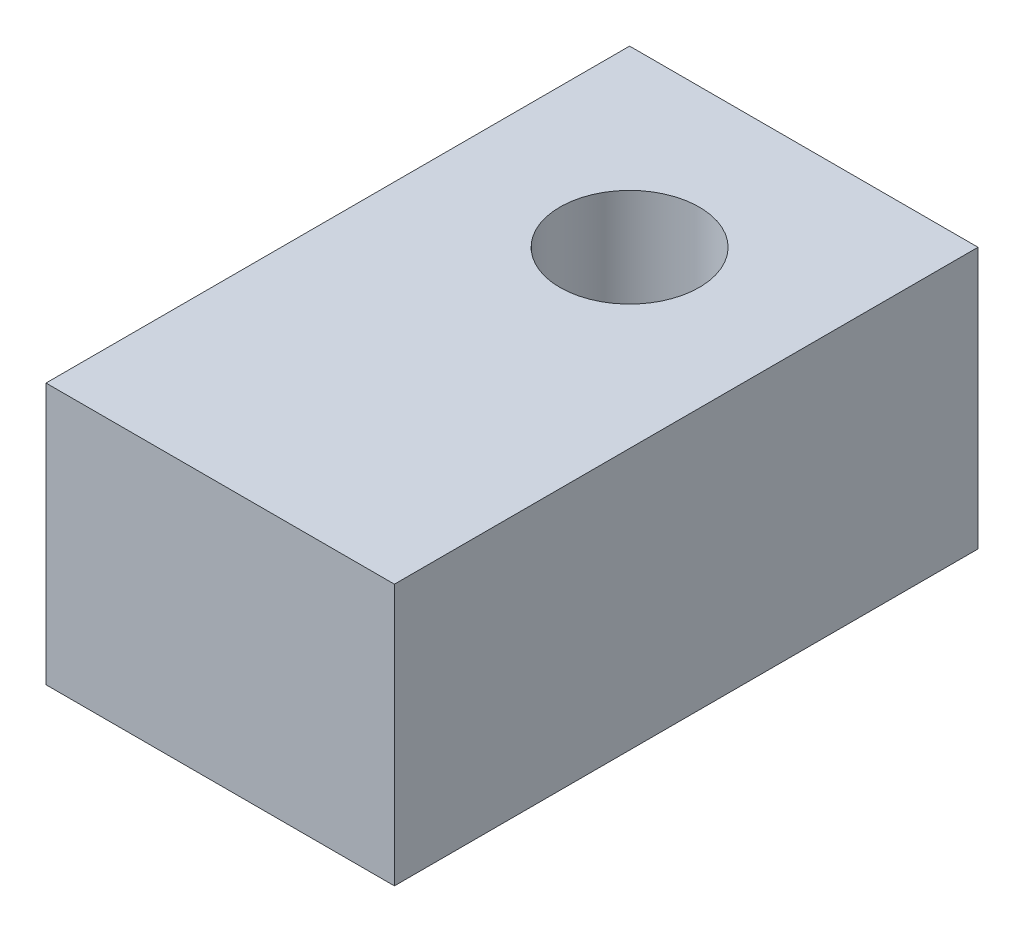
ISO-10303-21;
HEADER;
FILE_DESCRIPTION(('STEP AP214'),'2;1');
FILE_NAME('part.step','',(''),(''),'','','');
FILE_SCHEMA(('AUTOMOTIVE_DESIGN { 1 0 10303 214 1 1 1 1 }'));
ENDSEC;
DATA;
#1=APPLICATION_CONTEXT('core data for automotive mechanical design processes');
#2=APPLICATION_PROTOCOL_DEFINITION('international standard','automotive_design',2000,#1);
#3=PRODUCT_CONTEXT('',#1,'mechanical');
#4=PRODUCT('Part','Part','',(#3));
#5=PRODUCT_RELATED_PRODUCT_CATEGORY('part','',(#4));
#6=PRODUCT_DEFINITION_FORMATION('','',#4);
#7=PRODUCT_DEFINITION_CONTEXT('part definition',#1,'design');
#8=PRODUCT_DEFINITION('design','',#6,#7);
#9=PRODUCT_DEFINITION_SHAPE('','',#8);
#10=(LENGTH_UNIT() NAMED_UNIT(*) SI_UNIT(.MILLI.,.METRE.));
#11=(NAMED_UNIT(*) PLANE_ANGLE_UNIT() SI_UNIT($,.RADIAN.));
#12=(NAMED_UNIT(*) SI_UNIT($,.STERADIAN.) SOLID_ANGLE_UNIT());
#13=UNCERTAINTY_MEASURE_WITH_UNIT(LENGTH_MEASURE(1.E-05),#10,'distance_accuracy_value','');
#14=(GEOMETRIC_REPRESENTATION_CONTEXT(3) GLOBAL_UNCERTAINTY_ASSIGNED_CONTEXT((#13)) GLOBAL_UNIT_ASSIGNED_CONTEXT((#10,
#11,#12)) REPRESENTATION_CONTEXT('',''));
#15=CARTESIAN_POINT('',(0.,0.,0.));
#16=DIRECTION('',(0.,0.,1.));
#17=DIRECTION('',(1.,0.,0.));
#18=AXIS2_PLACEMENT_3D('',#15,#16,#17);
#19=CARTESIAN_POINT('',(-20.,15.,67.));
#20=DIRECTION('',(1.,0.,0.));
#21=DIRECTION('',(0.,0.,-1.));
#22=AXIS2_PLACEMENT_3D('',#19,#20,#21);
#23=PLANE('',#22);
#24=DIRECTION('',(0.,-1.,0.));
#25=VECTOR('',#24,1.);
#26=CARTESIAN_POINT('',(-20.,15.,0.));
#27=LINE('',#26,#25);
#28=CARTESIAN_POINT('',(-20.,15.,0.));
#29=VERTEX_POINT('',#28);
#30=CARTESIAN_POINT('',(-20.,-15.,0.));
#31=VERTEX_POINT('',#30);
#32=EDGE_CURVE('E94',#29,#31,#27,.T.);
#33=ORIENTED_EDGE('',*,*,#32,.T.);
#34=DIRECTION('',(0.,0.,-1.));
#35=VECTOR('',#34,1.);
#36=CARTESIAN_POINT('',(-20.,-15.,67.));
#37=LINE('',#36,#35);
#38=CARTESIAN_POINT('',(-20.,-15.,67.));
#39=VERTEX_POINT('',#38);
#40=EDGE_CURVE('E11',#39,#31,#37,.T.);
#41=ORIENTED_EDGE('',*,*,#40,.F.);
#42=DIRECTION('',(0.,-1.,0.));
#43=VECTOR('',#42,1.);
#44=CARTESIAN_POINT('',(-20.,15.,67.));
#45=LINE('',#44,#43);
#46=CARTESIAN_POINT('',(-20.,15.,67.));
#47=VERTEX_POINT('',#46);
#48=EDGE_CURVE('E82',#47,#39,#45,.T.);
#49=ORIENTED_EDGE('',*,*,#48,.F.);
#50=DIRECTION('',(0.,0.,-1.));
#51=VECTOR('',#50,1.);
#52=CARTESIAN_POINT('',(-20.,15.,67.));
#53=LINE('',#52,#51);
#54=EDGE_CURVE('E90',#47,#29,#53,.T.);
#55=ORIENTED_EDGE('',*,*,#54,.T.);
#56=EDGE_LOOP('',(#33,#41,#49,#55));
#57=FACE_BOUND('',#56,.T.);
#58=ADVANCED_FACE('F31',(#57),#23,.F.);
#59=CARTESIAN_POINT('',(-20.,-15.,67.));
#60=DIRECTION('',(0.,1.,0.));
#61=DIRECTION('',(0.,0.,1.));
#62=AXIS2_PLACEMENT_3D('',#59,#60,#61);
#63=PLANE('',#62);
#64=CARTESIAN_POINT('',(0.,-15.,20.));
#65=DIRECTION('',(0.,1.,0.));
#66=DIRECTION('',(0.,0.,1.));
#67=AXIS2_PLACEMENT_3D('',#64,#65,#66);
#68=CIRCLE('',#67,7.99999999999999);
#69=CARTESIAN_POINT('',(0.,-15.,28.));
#70=VERTEX_POINT('',#69);
#71=EDGE_CURVE('E110',#70,#70,#68,.T.);
#72=ORIENTED_EDGE('',*,*,#71,.T.);
#73=EDGE_LOOP('',(#72));
#74=FACE_BOUND('',#73,.T.);
#75=DIRECTION('',(1.,0.,0.));
#76=VECTOR('',#75,1.);
#77=CARTESIAN_POINT('',(-20.,-15.,0.));
#78=LINE('',#77,#76);
#79=CARTESIAN_POINT('',(20.,-15.,0.));
#80=VERTEX_POINT('',#79);
#81=EDGE_CURVE('E86',#31,#80,#78,.T.);
#82=ORIENTED_EDGE('',*,*,#81,.T.);
#83=DIRECTION('',(0.,0.,-1.));
#84=VECTOR('',#83,1.);
#85=CARTESIAN_POINT('',(20.,-15.,67.));
#86=LINE('',#85,#84);
#87=CARTESIAN_POINT('',(20.,-15.,67.));
#88=VERTEX_POINT('',#87);
#89=EDGE_CURVE('E39',#88,#80,#86,.T.);
#90=ORIENTED_EDGE('',*,*,#89,.F.);
#91=DIRECTION('',(1.,0.,0.));
#92=VECTOR('',#91,1.);
#93=CARTESIAN_POINT('',(-20.,-15.,67.));
#94=LINE('',#93,#92);
#95=EDGE_CURVE('E77',#39,#88,#94,.T.);
#96=ORIENTED_EDGE('',*,*,#95,.F.);
#97=ORIENTED_EDGE('',*,*,#40,.T.);
#98=EDGE_LOOP('',(#82,#90,#96,#97));
#99=FACE_BOUND('',#98,.T.);
#100=ADVANCED_FACE('F85',(#74,#99),#63,.F.);
#101=CARTESIAN_POINT('',(20.,15.,67.));
#102=DIRECTION('',(-1.,0.,0.));
#103=DIRECTION('',(0.,-1.,0.));
#104=AXIS2_PLACEMENT_3D('',#101,#102,#103);
#105=PLANE('',#104);
#106=DIRECTION('',(0.,1.,0.));
#107=VECTOR('',#106,1.);
#108=CARTESIAN_POINT('',(20.,15.,0.));
#109=LINE('',#108,#107);
#110=CARTESIAN_POINT('',(20.,15.,0.));
#111=VERTEX_POINT('',#110);
#112=EDGE_CURVE('E64',#80,#111,#109,.T.);
#113=ORIENTED_EDGE('',*,*,#112,.T.);
#114=DIRECTION('',(0.,0.,-1.));
#115=VECTOR('',#114,1.);
#116=CARTESIAN_POINT('',(20.,15.,67.));
#117=LINE('',#116,#115);
#118=CARTESIAN_POINT('',(20.,15.,67.));
#119=VERTEX_POINT('',#118);
#120=EDGE_CURVE('E87',#119,#111,#117,.T.);
#121=ORIENTED_EDGE('',*,*,#120,.F.);
#122=DIRECTION('',(0.,1.,0.));
#123=VECTOR('',#122,1.);
#124=CARTESIAN_POINT('',(20.,15.,67.));
#125=LINE('',#124,#123);
#126=EDGE_CURVE('E80',#88,#119,#125,.T.);
#127=ORIENTED_EDGE('',*,*,#126,.F.);
#128=ORIENTED_EDGE('',*,*,#89,.T.);
#129=EDGE_LOOP('',(#113,#121,#127,#128));
#130=FACE_BOUND('',#129,.T.);
#131=ADVANCED_FACE('F88',(#130),#105,.F.);
#132=CARTESIAN_POINT('',(-20.,15.,67.));
#133=DIRECTION('',(0.,-1.,0.));
#134=DIRECTION('',(0.,0.,-1.));
#135=AXIS2_PLACEMENT_3D('',#132,#133,#134);
#136=PLANE('',#135);
#137=CARTESIAN_POINT('',(0.,15.,20.));
#138=DIRECTION('',(0.,1.,0.));
#139=DIRECTION('',(0.,0.,1.));
#140=AXIS2_PLACEMENT_3D('',#137,#138,#139);
#141=CIRCLE('',#140,8.);
#142=CARTESIAN_POINT('',(0.,15.,28.));
#143=VERTEX_POINT('',#142);
#144=EDGE_CURVE('E97',#143,#143,#141,.T.);
#145=ORIENTED_EDGE('',*,*,#144,.F.);
#146=EDGE_LOOP('',(#145));
#147=FACE_BOUND('',#146,.T.);
#148=DIRECTION('',(-1.,0.,0.));
#149=VECTOR('',#148,1.);
#150=CARTESIAN_POINT('',(-20.,15.,0.));
#151=LINE('',#150,#149);
#152=EDGE_CURVE('E70',#111,#29,#151,.T.);
#153=ORIENTED_EDGE('',*,*,#152,.T.);
#154=ORIENTED_EDGE('',*,*,#54,.F.);
#155=DIRECTION('',(-1.,0.,0.));
#156=VECTOR('',#155,1.);
#157=CARTESIAN_POINT('',(-20.,15.,67.));
#158=LINE('',#157,#156);
#159=EDGE_CURVE('E47',#119,#47,#158,.T.);
#160=ORIENTED_EDGE('',*,*,#159,.F.);
#161=ORIENTED_EDGE('',*,*,#120,.T.);
#162=EDGE_LOOP('',(#153,#154,#160,#161));
#163=FACE_BOUND('',#162,.T.);
#164=ADVANCED_FACE('F102',(#147,#163),#136,.F.);
#165=CARTESIAN_POINT('',(-20.,-15.,67.));
#166=DIRECTION('',(0.,0.,1.));
#167=DIRECTION('',(1.,0.,0.));
#168=AXIS2_PLACEMENT_3D('',#165,#166,#167);
#169=PLANE('',#168);
#170=ORIENTED_EDGE('',*,*,#48,.T.);
#171=ORIENTED_EDGE('',*,*,#95,.T.);
#172=ORIENTED_EDGE('',*,*,#126,.T.);
#173=ORIENTED_EDGE('',*,*,#159,.T.);
#174=EDGE_LOOP('',(#170,#171,#172,#173));
#175=FACE_BOUND('',#174,.T.);
#176=ADVANCED_FACE('F78',(#175),#169,.T.);
#177=CARTESIAN_POINT('',(-20.,-15.,0.));
#178=DIRECTION('',(0.,0.,1.));
#179=DIRECTION('',(1.,0.,0.));
#180=AXIS2_PLACEMENT_3D('',#177,#178,#179);
#181=PLANE('',#180);
#182=ORIENTED_EDGE('',*,*,#32,.F.);
#183=ORIENTED_EDGE('',*,*,#152,.F.);
#184=ORIENTED_EDGE('',*,*,#112,.F.);
#185=ORIENTED_EDGE('',*,*,#81,.F.);
#186=EDGE_LOOP('',(#182,#183,#184,#185));
#187=FACE_BOUND('',#186,.T.);
#188=ADVANCED_FACE('F105',(#187),#181,.F.);
#189=CARTESIAN_POINT('',(0.,15.,20.));
#190=DIRECTION('',(0.,1.,0.));
#191=DIRECTION('',(0.,0.,1.));
#192=AXIS2_PLACEMENT_3D('',#189,#190,#191);
#193=CYLINDRICAL_SURFACE('',#192,7.99999999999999);
#194=ORIENTED_EDGE('',*,*,#71,.F.);
#195=EDGE_LOOP('',(#194));
#196=FACE_BOUND('',#195,.T.);
#197=ORIENTED_EDGE('',*,*,#144,.T.);
#198=EDGE_LOOP('',(#197));
#199=FACE_BOUND('',#198,.T.);
#200=ADVANCED_FACE('F115',(#196,#199),#193,.F.);
#201=CLOSED_SHELL('',(#58,#100,#131,#164,#176,#188,#200));
#202=MANIFOLD_SOLID_BREP('B2',#201);
#203=ADVANCED_BREP_SHAPE_REPRESENTATION('',(#18,#202),#14);
#204=SHAPE_DEFINITION_REPRESENTATION(#9,#203);
ENDSEC;
END-ISO-10303-21;
